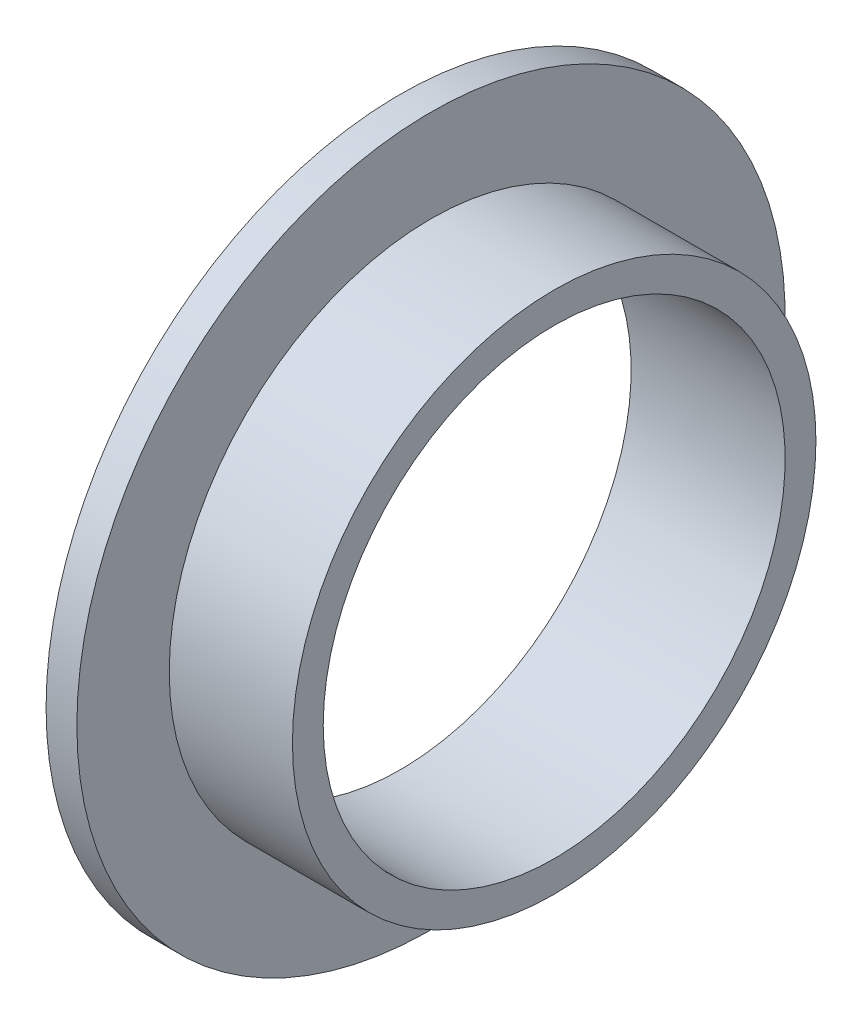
ISO-10303-21;
HEADER;
FILE_DESCRIPTION(('STEP AP214'),'2;1');
FILE_NAME('part.step','',(''),(''),'','','');
FILE_SCHEMA(('AUTOMOTIVE_DESIGN { 1 0 10303 214 1 1 1 1 }'));
ENDSEC;
DATA;
#1=APPLICATION_CONTEXT('core data for automotive mechanical design processes');
#2=APPLICATION_PROTOCOL_DEFINITION('international standard','automotive_design',2000,#1);
#3=PRODUCT_CONTEXT('',#1,'mechanical');
#4=PRODUCT('Part','Part','',(#3));
#5=PRODUCT_RELATED_PRODUCT_CATEGORY('part','',(#4));
#6=PRODUCT_DEFINITION_FORMATION('','',#4);
#7=PRODUCT_DEFINITION_CONTEXT('part definition',#1,'design');
#8=PRODUCT_DEFINITION('design','',#6,#7);
#9=PRODUCT_DEFINITION_SHAPE('','',#8);
#10=(LENGTH_UNIT() NAMED_UNIT(*) SI_UNIT(.MILLI.,.METRE.));
#11=(NAMED_UNIT(*) PLANE_ANGLE_UNIT() SI_UNIT($,.RADIAN.));
#12=(NAMED_UNIT(*) SI_UNIT($,.STERADIAN.) SOLID_ANGLE_UNIT());
#13=UNCERTAINTY_MEASURE_WITH_UNIT(LENGTH_MEASURE(1.E-05),#10,'distance_accuracy_value','');
#14=(GEOMETRIC_REPRESENTATION_CONTEXT(3) GLOBAL_UNCERTAINTY_ASSIGNED_CONTEXT((#13)) GLOBAL_UNIT_ASSIGNED_CONTEXT((#10,
#11,#12)) REPRESENTATION_CONTEXT('',''));
#15=CARTESIAN_POINT('',(0.,0.,0.));
#16=DIRECTION('',(0.,0.,1.));
#17=DIRECTION('',(1.,0.,0.));
#18=AXIS2_PLACEMENT_3D('',#15,#16,#17);
#19=CARTESIAN_POINT('',(-1000.,0.,0.));
#20=DIRECTION('',(-1.,0.,0.));
#21=DIRECTION('',(0.,0.,1.));
#22=AXIS2_PLACEMENT_3D('',#19,#20,#21);
#23=CYLINDRICAL_SURFACE('',#22,8.5);
#24=CARTESIAN_POINT('',(0.99999999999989,0.,0.));
#25=DIRECTION('',(-1.,0.,0.));
#26=DIRECTION('',(0.,0.,1.));
#27=AXIS2_PLACEMENT_3D('',#24,#25,#26);
#28=CIRCLE('',#27,8.5);
#29=CARTESIAN_POINT('',(0.99999999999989,0.,8.5));
#30=VERTEX_POINT('',#29);
#31=EDGE_CURVE('E34',#30,#30,#28,.F.);
#32=ORIENTED_EDGE('',*,*,#31,.T.);
#33=EDGE_LOOP('',(#32));
#34=FACE_BOUND('',#33,.T.);
#35=CARTESIAN_POINT('',(4.99999999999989,0.,0.));
#36=DIRECTION('',(-1.,0.,0.));
#37=DIRECTION('',(0.,0.,1.));
#38=AXIS2_PLACEMENT_3D('',#35,#36,#37);
#39=CIRCLE('',#38,8.5);
#40=CARTESIAN_POINT('',(4.99999999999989,0.,8.5));
#41=VERTEX_POINT('',#40);
#42=EDGE_CURVE('E18',#41,#41,#39,.T.);
#43=ORIENTED_EDGE('',*,*,#42,.T.);
#44=EDGE_LOOP('',(#43));
#45=FACE_BOUND('',#44,.T.);
#46=ADVANCED_FACE('F15',(#34,#45),#23,.T.);
#47=CARTESIAN_POINT('',(5.,7.5,0.));
#48=DIRECTION('',(-1.,0.,0.));
#49=DIRECTION('',(0.,0.,1.));
#50=AXIS2_PLACEMENT_3D('',#47,#48,#49);
#51=PLANE('',#50);
#52=CARTESIAN_POINT('',(4.99999999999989,0.,0.));
#53=DIRECTION('',(-1.,0.,0.));
#54=DIRECTION('',(0.,0.,1.));
#55=AXIS2_PLACEMENT_3D('',#52,#53,#54);
#56=CIRCLE('',#55,7.5);
#57=CARTESIAN_POINT('',(4.99999999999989,0.,7.5));
#58=VERTEX_POINT('',#57);
#59=EDGE_CURVE('E32',#58,#58,#56,.T.);
#60=ORIENTED_EDGE('',*,*,#59,.T.);
#61=EDGE_LOOP('',(#60));
#62=FACE_BOUND('',#61,.T.);
#63=ORIENTED_EDGE('',*,*,#42,.F.);
#64=EDGE_LOOP('',(#63));
#65=FACE_BOUND('',#64,.T.);
#66=ADVANCED_FACE('F42',(#62,#65),#51,.F.);
#67=CARTESIAN_POINT('',(1.,8.5,0.));
#68=DIRECTION('',(-1.,0.,0.));
#69=DIRECTION('',(0.,0.,1.));
#70=AXIS2_PLACEMENT_3D('',#67,#68,#69);
#71=PLANE('',#70);
#72=ORIENTED_EDGE('',*,*,#31,.F.);
#73=EDGE_LOOP('',(#72));
#74=FACE_BOUND('',#73,.T.);
#75=CARTESIAN_POINT('',(0.99999999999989,0.,0.));
#76=DIRECTION('',(-1.,0.,0.));
#77=DIRECTION('',(0.,0.,1.));
#78=AXIS2_PLACEMENT_3D('',#75,#76,#77);
#79=CIRCLE('',#78,11.5);
#80=CARTESIAN_POINT('',(0.99999999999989,0.,11.5));
#81=VERTEX_POINT('',#80);
#82=EDGE_CURVE('E27',#81,#81,#79,.T.);
#83=ORIENTED_EDGE('',*,*,#82,.F.);
#84=EDGE_LOOP('',(#83));
#85=FACE_BOUND('',#84,.T.);
#86=ADVANCED_FACE('F44',(#74,#85),#71,.F.);
#87=CARTESIAN_POINT('',(-1000.,0.,0.));
#88=DIRECTION('',(-1.,0.,0.));
#89=DIRECTION('',(0.,0.,1.));
#90=AXIS2_PLACEMENT_3D('',#87,#88,#89);
#91=CYLINDRICAL_SURFACE('',#90,7.5);
#92=ORIENTED_EDGE('',*,*,#59,.F.);
#93=EDGE_LOOP('',(#92));
#94=FACE_BOUND('',#93,.T.);
#95=CARTESIAN_POINT('',(0.,0.,0.));
#96=DIRECTION('',(-1.,0.,0.));
#97=DIRECTION('',(0.,0.,1.));
#98=AXIS2_PLACEMENT_3D('',#95,#96,#97);
#99=CIRCLE('',#98,7.5);
#100=CARTESIAN_POINT('',(0.,0.,7.5));
#101=VERTEX_POINT('',#100);
#102=EDGE_CURVE('E22',#101,#101,#99,.T.);
#103=ORIENTED_EDGE('',*,*,#102,.T.);
#104=EDGE_LOOP('',(#103));
#105=FACE_BOUND('',#104,.T.);
#106=ADVANCED_FACE('F51',(#94,#105),#91,.F.);
#107=CARTESIAN_POINT('',(-1000.,0.,0.));
#108=DIRECTION('',(-1.,0.,0.));
#109=DIRECTION('',(0.,0.,1.));
#110=AXIS2_PLACEMENT_3D('',#107,#108,#109);
#111=CYLINDRICAL_SURFACE('',#110,11.5);
#112=CARTESIAN_POINT('',(0.,0.,0.));
#113=DIRECTION('',(-1.,0.,0.));
#114=DIRECTION('',(0.,0.,1.));
#115=AXIS2_PLACEMENT_3D('',#112,#113,#114);
#116=CIRCLE('',#115,11.5);
#117=CARTESIAN_POINT('',(0.,0.,11.5));
#118=VERTEX_POINT('',#117);
#119=EDGE_CURVE('E10',#118,#118,#116,.F.);
#120=ORIENTED_EDGE('',*,*,#119,.T.);
#121=EDGE_LOOP('',(#120));
#122=FACE_BOUND('',#121,.T.);
#123=ORIENTED_EDGE('',*,*,#82,.T.);
#124=EDGE_LOOP('',(#123));
#125=FACE_BOUND('',#124,.T.);
#126=ADVANCED_FACE('F56',(#122,#125),#111,.T.);
#127=CARTESIAN_POINT('',(0.,11.5,0.));
#128=DIRECTION('',(1.,0.,0.));
#129=DIRECTION('',(0.,0.,-1.));
#130=AXIS2_PLACEMENT_3D('',#127,#128,#129);
#131=PLANE('',#130);
#132=ORIENTED_EDGE('',*,*,#119,.F.);
#133=EDGE_LOOP('',(#132));
#134=FACE_BOUND('',#133,.T.);
#135=ORIENTED_EDGE('',*,*,#102,.F.);
#136=EDGE_LOOP('',(#135));
#137=FACE_BOUND('',#136,.T.);
#138=ADVANCED_FACE('F54',(#134,#137),#131,.F.);
#139=CLOSED_SHELL('',(#46,#66,#86,#106,#126,#138));
#140=MANIFOLD_SOLID_BREP('B1',#139);
#141=ADVANCED_BREP_SHAPE_REPRESENTATION('',(#18,#140),#14);
#142=SHAPE_DEFINITION_REPRESENTATION(#9,#141);
ENDSEC;
END-ISO-10303-21;
